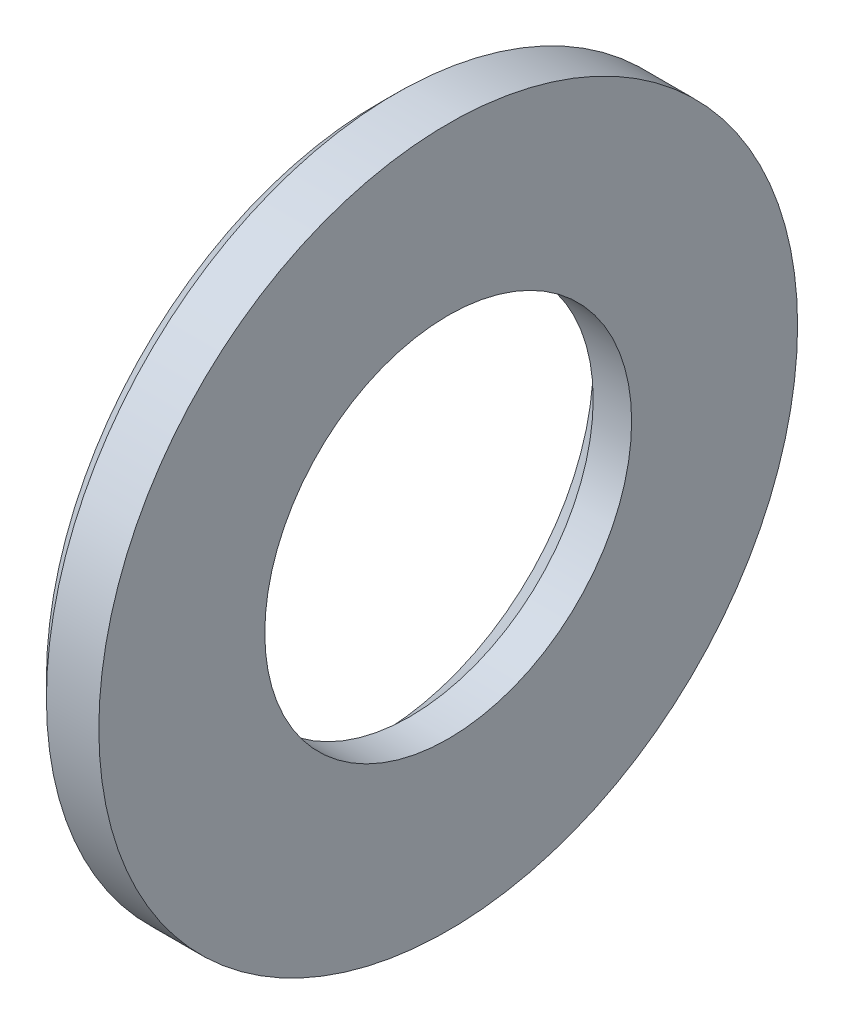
from build123d import *


with BuildPart() as part:
    # Sketch1 → Base-Revolve (revolve)
    with BuildSketch(Plane.XY, mode=Mode.PRIVATE) as base_revolve_sk:
        Polygon((0, 10.5), (0, 20), (-3, 20), (-4, 19), (-4, 12.3), (-2.2, 10.5), align=None)
    revolve(base_revolve_sk.sketch.rotate(Axis((-34.925, 0, 0), (1, 0, 0)), 90), axis=Axis((-34.925, 0, 0), (1, 0, 0)))


solid = part.part
